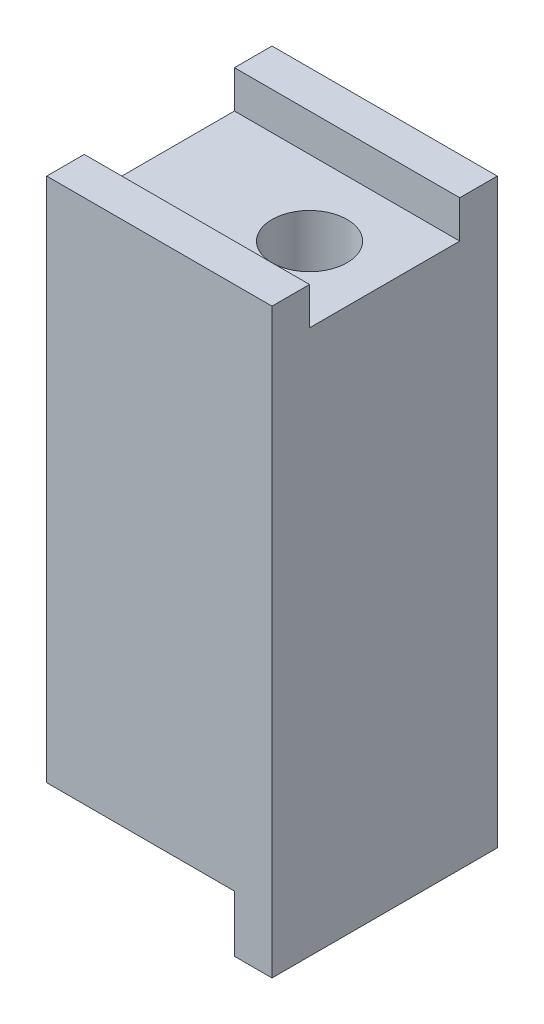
from build123d import *

# Parameters (mm, degrees)
BOSS_EXTRUDE1_DEPTH               = 9.525
CUT_EXTRUDE1_DEPTH                = 6.35
F_1_4_20_TAPPED_HOLE1_D           = 5.1054
F_1_4_20_TAPPED_HOLE1_DEPTH       = 16.51
F_1_4_20_TAPPED_HOLE1_CBORE_D     = 6.35
F_1_4_20_TAPPED_HOLE1_CBORE_DEPTH = 12.7
F_1_4_20_TAPPED_HOLE1_TIP         = 1.533816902
F_1_4_20_TAPPED_HOLE2_D           = 5.1054
F_1_4_20_TAPPED_HOLE2_DEPTH       = 16.51
F_1_4_20_TAPPED_HOLE2_CBORE_D     = 6.35
F_1_4_20_TAPPED_HOLE2_CBORE_DEPTH = 12.7
F_1_4_20_TAPPED_HOLE2_TIP         = 1.533816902


with BuildPart() as part:
    # Sketch2 → Boss-Extrude1 (new, symmetric)
    with BuildSketch(Plane.XY):
        Polygon((9.525, -49.1998), (6.35, -49.1998), (6.35, -44.4246), (-9.525, -44.4246), (-9.525, 0), (0, 0), (9.525, 0), align=None)
    extrude(amount=BOSS_EXTRUDE1_DEPTH, both=True)

    # Sketch3 → Cut-Extrude1 (cut, symmetric)
    with BuildSketch(Plane.XY):
        Polygon((-9.525, 0), (0, 0), (9.525, 0), (9.525, -3.175), (-9.525, -3.175), align=None)
    extrude(amount=CUT_EXTRUDE1_DEPTH, both=True, mode=Mode.SUBTRACT)

    # 1_4-20 Tapped Hole1
    with Locations(Plane(origin=(0, -3.175, 0), x_dir=(1, 0, 0), z_dir=(0, 1, 0))):
        with Locations((3.175, 0)):
            CounterBoreHole(F_1_4_20_TAPPED_HOLE1_D / 2, F_1_4_20_TAPPED_HOLE1_CBORE_D / 2, F_1_4_20_TAPPED_HOLE1_CBORE_DEPTH, depth=F_1_4_20_TAPPED_HOLE1_DEPTH)
            with Locations((0, 0, -(F_1_4_20_TAPPED_HOLE1_DEPTH + F_1_4_20_TAPPED_HOLE1_TIP / 2))):  # 118° drill point
                Cone(0, F_1_4_20_TAPPED_HOLE1_D / 2, F_1_4_20_TAPPED_HOLE1_TIP, mode=Mode.SUBTRACT)

    # 1_4-20 Tapped Hole2
    with Locations(Plane(origin=(0, -44.4246, 0), x_dir=(-1, 0, 0), z_dir=(0, -1, 0))):
        with Locations((3.175, 0)):
            CounterBoreHole(F_1_4_20_TAPPED_HOLE2_D / 2, F_1_4_20_TAPPED_HOLE2_CBORE_D / 2, F_1_4_20_TAPPED_HOLE2_CBORE_DEPTH, depth=F_1_4_20_TAPPED_HOLE2_DEPTH)
            with Locations((0, 0, -(F_1_4_20_TAPPED_HOLE2_DEPTH + F_1_4_20_TAPPED_HOLE2_TIP / 2))):  # 118° drill point
                Cone(0, F_1_4_20_TAPPED_HOLE2_D / 2, F_1_4_20_TAPPED_HOLE2_TIP, mode=Mode.SUBTRACT)


solid = part.part
